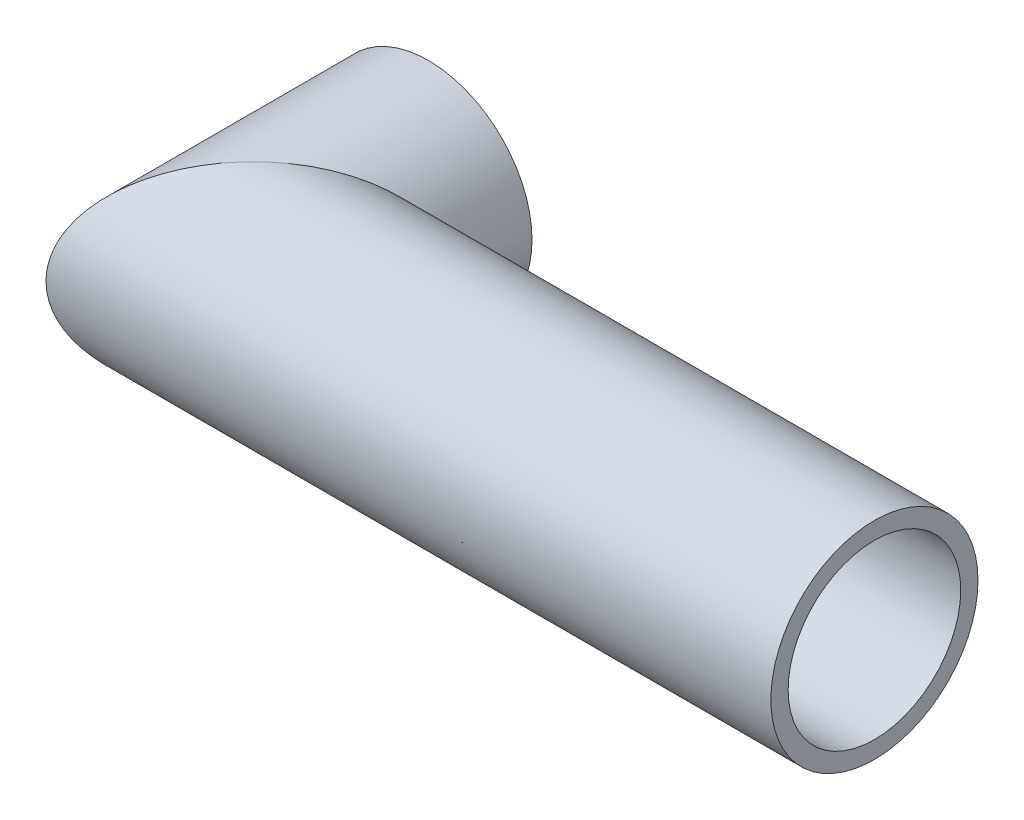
ISO-10303-21;
HEADER;
FILE_DESCRIPTION(('STEP AP214'),'2;1');
FILE_NAME('part.step','',(''),(''),'','','');
FILE_SCHEMA(('AUTOMOTIVE_DESIGN { 1 0 10303 214 1 1 1 1 }'));
ENDSEC;
DATA;
#1=APPLICATION_CONTEXT('core data for automotive mechanical design processes');
#2=APPLICATION_PROTOCOL_DEFINITION('international standard','automotive_design',2000,#1);
#3=PRODUCT_CONTEXT('',#1,'mechanical');
#4=PRODUCT('Part','Part','',(#3));
#5=PRODUCT_RELATED_PRODUCT_CATEGORY('part','',(#4));
#6=PRODUCT_DEFINITION_FORMATION('','',#4);
#7=PRODUCT_DEFINITION_CONTEXT('part definition',#1,'design');
#8=PRODUCT_DEFINITION('design','',#6,#7);
#9=PRODUCT_DEFINITION_SHAPE('','',#8);
#10=(LENGTH_UNIT() NAMED_UNIT(*) SI_UNIT(.MILLI.,.METRE.));
#11=(NAMED_UNIT(*) PLANE_ANGLE_UNIT() SI_UNIT($,.RADIAN.));
#12=(NAMED_UNIT(*) SI_UNIT($,.STERADIAN.) SOLID_ANGLE_UNIT());
#13=UNCERTAINTY_MEASURE_WITH_UNIT(LENGTH_MEASURE(1.E-05),#10,'distance_accuracy_value','');
#14=(GEOMETRIC_REPRESENTATION_CONTEXT(3) GLOBAL_UNCERTAINTY_ASSIGNED_CONTEXT((#13)) GLOBAL_UNIT_ASSIGNED_CONTEXT((#10,
#11,#12)) REPRESENTATION_CONTEXT('',''));
#15=CARTESIAN_POINT('',(0.,0.,0.));
#16=DIRECTION('',(0.,0.,1.));
#17=DIRECTION('',(1.,0.,0.));
#18=AXIS2_PLACEMENT_3D('',#15,#16,#17);
#19=CARTESIAN_POINT('',(-6.7,0.,10.16));
#20=DIRECTION('',(1.,0.,0.));
#21=DIRECTION('',(0.,0.,-1.));
#22=AXIS2_PLACEMENT_3D('',#19,#20,#21);
#23=CYLINDRICAL_SURFACE('',#22,6.);
#24=CARTESIAN_POINT('',(0.,0.,10.16));
#25=DIRECTION('',(0.707106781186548,0.,0.707106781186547));
#26=DIRECTION('',(-0.707106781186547,0.,0.707106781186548));
#27=AXIS2_PLACEMENT_3D('',#24,#25,#26);
#28=ELLIPSE('',#27,8.48528137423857,6.);
#29=CARTESIAN_POINT('',(-6.,0.,16.16));
#30=VERTEX_POINT('',#29);
#31=EDGE_CURVE('E42',#30,#30,#28,.F.);
#32=ORIENTED_EDGE('',*,*,#31,.F.);
#33=EDGE_LOOP('',(#32));
#34=FACE_BOUND('',#33,.T.);
#35=CARTESIAN_POINT('',(36.,0.,10.16));
#36=DIRECTION('',(1.,0.,0.));
#37=DIRECTION('',(0.,0.,-1.));
#38=AXIS2_PLACEMENT_3D('',#35,#36,#37);
#39=CIRCLE('',#38,6.);
#40=CARTESIAN_POINT('',(36.,0.,4.16));
#41=VERTEX_POINT('',#40);
#42=EDGE_CURVE('E54',#41,#41,#39,.T.);
#43=ORIENTED_EDGE('',*,*,#42,.F.);
#44=EDGE_LOOP('',(#43));
#45=FACE_BOUND('',#44,.T.);
#46=ADVANCED_FACE('F39',(#34,#45),#23,.T.);
#47=CARTESIAN_POINT('',(0.,0.,0.));
#48=DIRECTION('',(0.,0.,1.));
#49=DIRECTION('',(1.,0.,0.));
#50=AXIS2_PLACEMENT_3D('',#47,#48,#49);
#51=CYLINDRICAL_SURFACE('',#50,6.);
#52=CARTESIAN_POINT('',(0.,0.,0.));
#53=DIRECTION('',(0.,0.,1.));
#54=DIRECTION('',(1.,0.,0.));
#55=AXIS2_PLACEMENT_3D('',#52,#53,#54);
#56=CIRCLE('',#55,6.);
#57=CARTESIAN_POINT('',(6.,0.,0.));
#58=VERTEX_POINT('',#57);
#59=EDGE_CURVE('E60',#58,#58,#56,.T.);
#60=ORIENTED_EDGE('',*,*,#59,.T.);
#61=EDGE_LOOP('',(#60));
#62=FACE_BOUND('',#61,.T.);
#63=ORIENTED_EDGE('',*,*,#31,.T.);
#64=EDGE_LOOP('',(#63));
#65=FACE_BOUND('',#64,.T.);
#66=ADVANCED_FACE('F90',(#62,#65),#51,.T.);
#67=CARTESIAN_POINT('',(36.,0.,10.16));
#68=DIRECTION('',(1.,0.,0.));
#69=DIRECTION('',(0.,0.,-1.));
#70=AXIS2_PLACEMENT_3D('',#67,#68,#69);
#71=PLANE('',#70);
#72=CARTESIAN_POINT('',(36.,0.,10.16));
#73=DIRECTION('',(1.,0.,0.));
#74=DIRECTION('',(0.,0.,-1.));
#75=AXIS2_PLACEMENT_3D('',#72,#73,#74);
#76=CIRCLE('',#75,5.);
#77=CARTESIAN_POINT('',(36.,0.,5.16));
#78=VERTEX_POINT('',#77);
#79=EDGE_CURVE('E80',#78,#78,#76,.F.);
#80=ORIENTED_EDGE('',*,*,#79,.T.);
#81=EDGE_LOOP('',(#80));
#82=FACE_BOUND('',#81,.T.);
#83=ORIENTED_EDGE('',*,*,#42,.T.);
#84=EDGE_LOOP('',(#83));
#85=FACE_BOUND('',#84,.T.);
#86=ADVANCED_FACE('F92',(#82,#85),#71,.T.);
#87=CARTESIAN_POINT('',(0.,0.,0.));
#88=DIRECTION('',(0.,0.,1.));
#89=DIRECTION('',(1.,0.,0.));
#90=AXIS2_PLACEMENT_3D('',#87,#88,#89);
#91=PLANE('',#90);
#92=CARTESIAN_POINT('',(0.,0.,0.));
#93=DIRECTION('',(0.,0.,1.));
#94=DIRECTION('',(1.,0.,0.));
#95=AXIS2_PLACEMENT_3D('',#92,#93,#94);
#96=CIRCLE('',#95,5.);
#97=CARTESIAN_POINT('',(5.,0.,0.));
#98=VERTEX_POINT('',#97);
#99=EDGE_CURVE('E48',#98,#98,#96,.F.);
#100=ORIENTED_EDGE('',*,*,#99,.F.);
#101=EDGE_LOOP('',(#100));
#102=FACE_BOUND('',#101,.T.);
#103=ORIENTED_EDGE('',*,*,#59,.F.);
#104=EDGE_LOOP('',(#103));
#105=FACE_BOUND('',#104,.T.);
#106=ADVANCED_FACE('F76',(#102,#105),#91,.F.);
#107=CARTESIAN_POINT('',(-5.6,0.,10.16));
#108=DIRECTION('',(1.,0.,0.));
#109=DIRECTION('',(0.,0.,-1.));
#110=AXIS2_PLACEMENT_3D('',#107,#108,#109);
#111=CYLINDRICAL_SURFACE('',#110,5.);
#112=CARTESIAN_POINT('',(0.,0.,10.16));
#113=DIRECTION('',(0.707106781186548,0.,0.707106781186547));
#114=DIRECTION('',(-0.707106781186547,0.,0.707106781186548));
#115=AXIS2_PLACEMENT_3D('',#112,#113,#114);
#116=ELLIPSE('',#115,7.07106781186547,5.);
#117=CARTESIAN_POINT('',(-5.,0.,15.16));
#118=VERTEX_POINT('',#117);
#119=EDGE_CURVE('E11',#118,#118,#116,.T.);
#120=ORIENTED_EDGE('',*,*,#119,.F.);
#121=EDGE_LOOP('',(#120));
#122=FACE_BOUND('',#121,.T.);
#123=ORIENTED_EDGE('',*,*,#79,.F.);
#124=EDGE_LOOP('',(#123));
#125=FACE_BOUND('',#124,.T.);
#126=ADVANCED_FACE('F101',(#122,#125),#111,.F.);
#127=CARTESIAN_POINT('',(0.,0.,0.));
#128=DIRECTION('',(0.,0.,1.));
#129=DIRECTION('',(1.,0.,0.));
#130=AXIS2_PLACEMENT_3D('',#127,#128,#129);
#131=CYLINDRICAL_SURFACE('',#130,5.);
#132=ORIENTED_EDGE('',*,*,#99,.T.);
#133=EDGE_LOOP('',(#132));
#134=FACE_BOUND('',#133,.T.);
#135=ORIENTED_EDGE('',*,*,#119,.T.);
#136=EDGE_LOOP('',(#135));
#137=FACE_BOUND('',#136,.T.);
#138=ADVANCED_FACE('F99',(#134,#137),#131,.F.);
#139=CLOSED_SHELL('',(#46,#66,#86,#106,#126,#138));
#140=MANIFOLD_SOLID_BREP('B2',#139);
#141=ADVANCED_BREP_SHAPE_REPRESENTATION('',(#18,#140),#14);
#142=SHAPE_DEFINITION_REPRESENTATION(#9,#141);
ENDSEC;
END-ISO-10303-21;
